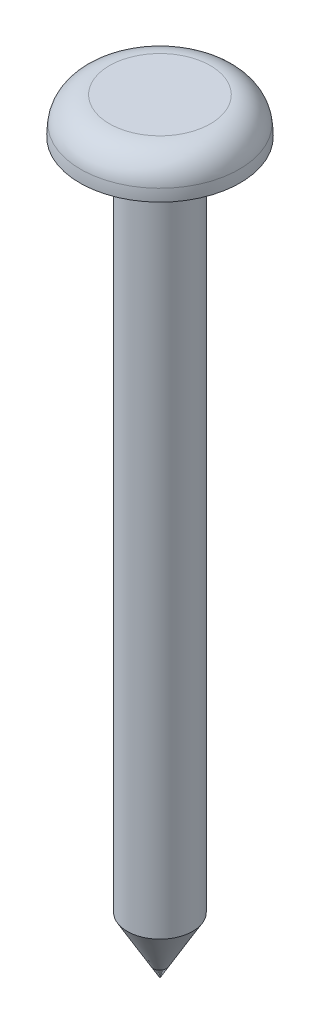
ISO-10303-21;
HEADER;
FILE_DESCRIPTION(('STEP AP214'),'2;1');
FILE_NAME('part.step','',(''),(''),'','','');
FILE_SCHEMA(('AUTOMOTIVE_DESIGN { 1 0 10303 214 1 1 1 1 }'));
ENDSEC;
DATA;
#1=APPLICATION_CONTEXT('core data for automotive mechanical design processes');
#2=APPLICATION_PROTOCOL_DEFINITION('international standard','automotive_design',2000,#1);
#3=PRODUCT_CONTEXT('',#1,'mechanical');
#4=PRODUCT('Part','Part','',(#3));
#5=PRODUCT_RELATED_PRODUCT_CATEGORY('part','',(#4));
#6=PRODUCT_DEFINITION_FORMATION('','',#4);
#7=PRODUCT_DEFINITION_CONTEXT('part definition',#1,'design');
#8=PRODUCT_DEFINITION('design','',#6,#7);
#9=PRODUCT_DEFINITION_SHAPE('','',#8);
#10=(LENGTH_UNIT() NAMED_UNIT(*) SI_UNIT(.MILLI.,.METRE.));
#11=(NAMED_UNIT(*) PLANE_ANGLE_UNIT() SI_UNIT($,.RADIAN.));
#12=(NAMED_UNIT(*) SI_UNIT($,.STERADIAN.) SOLID_ANGLE_UNIT());
#13=UNCERTAINTY_MEASURE_WITH_UNIT(LENGTH_MEASURE(1.E-05),#10,'distance_accuracy_value','');
#14=(GEOMETRIC_REPRESENTATION_CONTEXT(3) GLOBAL_UNCERTAINTY_ASSIGNED_CONTEXT((#13)) GLOBAL_UNIT_ASSIGNED_CONTEXT((#10,
#11,#12)) REPRESENTATION_CONTEXT('',''));
#15=CARTESIAN_POINT('',(0.,0.,0.));
#16=DIRECTION('',(0.,0.,1.));
#17=DIRECTION('',(1.,0.,0.));
#18=AXIS2_PLACEMENT_3D('',#15,#16,#17);
#19=CARTESIAN_POINT('',(0.,1.,0.));
#20=DIRECTION('',(0.,1.,0.));
#21=DIRECTION('',(-1.,0.,0.));
#22=AXIS2_PLACEMENT_3D('',#19,#20,#21);
#23=PLANE('',#22);
#24=CARTESIAN_POINT('',(0.,1.,0.));
#25=DIRECTION('',(0.,1.,0.));
#26=DIRECTION('',(-1.,0.,0.));
#27=AXIS2_PLACEMENT_3D('',#24,#25,#26);
#28=CIRCLE('',#27,1.3856406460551);
#29=CARTESIAN_POINT('',(-1.3856406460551,1.,0.));
#30=VERTEX_POINT('',#29);
#31=EDGE_CURVE('E11',#30,#30,#28,.T.);
#32=ORIENTED_EDGE('',*,*,#31,.T.);
#33=EDGE_LOOP('',(#32));
#34=FACE_BOUND('',#33,.T.);
#35=ADVANCED_FACE('F33',(#34),#23,.T.);
#36=CARTESIAN_POINT('',(0.,0.2,0.));
#37=DIRECTION('',(0.,1.,0.));
#38=DIRECTION('',(-1.,0.,0.));
#39=AXIS2_PLACEMENT_3D('',#36,#37,#38);
#40=TOROIDAL_SURFACE('',#39,1.3856406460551,0.8);
#41=CARTESIAN_POINT('',(0.,0.314285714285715,0.));
#42=DIRECTION('',(0.,1.,0.));
#43=DIRECTION('',(-1.,0.,0.));
#44=AXIS2_PLACEMENT_3D('',#41,#42,#43);
#45=CIRCLE('',#44,2.17743530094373);
#46=CARTESIAN_POINT('',(-2.17743530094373,0.314285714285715,0.));
#47=VERTEX_POINT('',#46);
#48=EDGE_CURVE('E39',#47,#47,#45,.T.);
#49=ORIENTED_EDGE('',*,*,#48,.T.);
#50=EDGE_LOOP('',(#49));
#51=FACE_BOUND('',#50,.T.);
#52=ORIENTED_EDGE('',*,*,#31,.F.);
#53=EDGE_LOOP('',(#52));
#54=FACE_BOUND('',#53,.T.);
#55=ADVANCED_FACE('F61',(#51,#54),#40,.T.);
#56=CARTESIAN_POINT('',(0.,0.,0.));
#57=DIRECTION('',(0.,1.,0.));
#58=DIRECTION('',(-1.,0.,0.));
#59=AXIS2_PLACEMENT_3D('',#56,#57,#58);
#60=SPHERICAL_SURFACE('',#59,2.2);
#61=CARTESIAN_POINT('',(0.,0.,0.));
#62=DIRECTION('',(0.,1.,0.));
#63=DIRECTION('',(-1.,0.,0.));
#64=AXIS2_PLACEMENT_3D('',#61,#62,#63);
#65=CIRCLE('',#64,2.2);
#66=CARTESIAN_POINT('',(-2.2,0.,0.));
#67=VERTEX_POINT('',#66);
#68=EDGE_CURVE('E54',#67,#67,#65,.T.);
#69=ORIENTED_EDGE('',*,*,#68,.T.);
#70=EDGE_LOOP('',(#69));
#71=FACE_BOUND('',#70,.T.);
#72=ORIENTED_EDGE('',*,*,#48,.F.);
#73=EDGE_LOOP('',(#72));
#74=FACE_BOUND('',#73,.T.);
#75=ADVANCED_FACE('F64',(#71,#74),#60,.T.);
#76=CARTESIAN_POINT('',(-0.9,0.,0.));
#77=DIRECTION('',(0.,-1.,0.));
#78=DIRECTION('',(1.,0.,0.));
#79=AXIS2_PLACEMENT_3D('',#76,#77,#78);
#80=PLANE('',#79);
#81=CARTESIAN_POINT('',(0.,0.,0.));
#82=DIRECTION('',(0.,1.,0.));
#83=DIRECTION('',(-1.,0.,0.));
#84=AXIS2_PLACEMENT_3D('',#81,#82,#83);
#85=CIRCLE('',#84,0.9);
#86=CARTESIAN_POINT('',(-0.9,0.,0.));
#87=VERTEX_POINT('',#86);
#88=EDGE_CURVE('E51',#87,#87,#85,.T.);
#89=ORIENTED_EDGE('',*,*,#88,.T.);
#90=EDGE_LOOP('',(#89));
#91=FACE_BOUND('',#90,.T.);
#92=ORIENTED_EDGE('',*,*,#68,.F.);
#93=EDGE_LOOP('',(#92));
#94=FACE_BOUND('',#93,.T.);
#95=ADVANCED_FACE('F66',(#91,#94),#80,.T.);
#96=CARTESIAN_POINT('',(0.,1.,0.));
#97=DIRECTION('',(0.,1.,0.));
#98=DIRECTION('',(-1.,0.,0.));
#99=AXIS2_PLACEMENT_3D('',#96,#97,#98);
#100=CYLINDRICAL_SURFACE('',#99,0.9);
#101=CARTESIAN_POINT('',(0.,-18.441154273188,0.));
#102=DIRECTION('',(0.,1.,0.));
#103=DIRECTION('',(-1.,0.,0.));
#104=AXIS2_PLACEMENT_3D('',#101,#102,#103);
#105=CIRCLE('',#104,0.9);
#106=CARTESIAN_POINT('',(-0.899999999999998,-18.441154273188,0.));
#107=VERTEX_POINT('',#106);
#108=EDGE_CURVE('E49',#107,#107,#105,.T.);
#109=ORIENTED_EDGE('',*,*,#108,.T.);
#110=EDGE_LOOP('',(#109));
#111=FACE_BOUND('',#110,.T.);
#112=ORIENTED_EDGE('',*,*,#88,.F.);
#113=EDGE_LOOP('',(#112));
#114=FACE_BOUND('',#113,.T.);
#115=ADVANCED_FACE('F45',(#111,#114),#100,.T.);
#116=CARTESIAN_POINT('',(0.,-18.441154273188,0.));
#117=DIRECTION('',(0.,1.,0.));
#118=DIRECTION('',(-1.,0.,0.));
#119=AXIS2_PLACEMENT_3D('',#116,#117,#118);
#120=CONICAL_SURFACE('',#119,0.9,0.523598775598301);
#121=CARTESIAN_POINT('',(0.,-20.,0.));
#122=VERTEX_POINT('',#121);
#123=VERTEX_LOOP('',#122);
#124=FACE_BOUND('',#123,.T.);
#125=ORIENTED_EDGE('',*,*,#108,.F.);
#126=EDGE_LOOP('',(#125));
#127=FACE_BOUND('',#126,.T.);
#128=ADVANCED_FACE('F42',(#124,#127),#120,.T.);
#129=CLOSED_SHELL('',(#35,#55,#75,#95,#115,#128));
#130=MANIFOLD_SOLID_BREP('B2',#129);
#131=ADVANCED_BREP_SHAPE_REPRESENTATION('',(#18,#130),#14);
#132=SHAPE_DEFINITION_REPRESENTATION(#9,#131);
ENDSEC;
END-ISO-10303-21;
